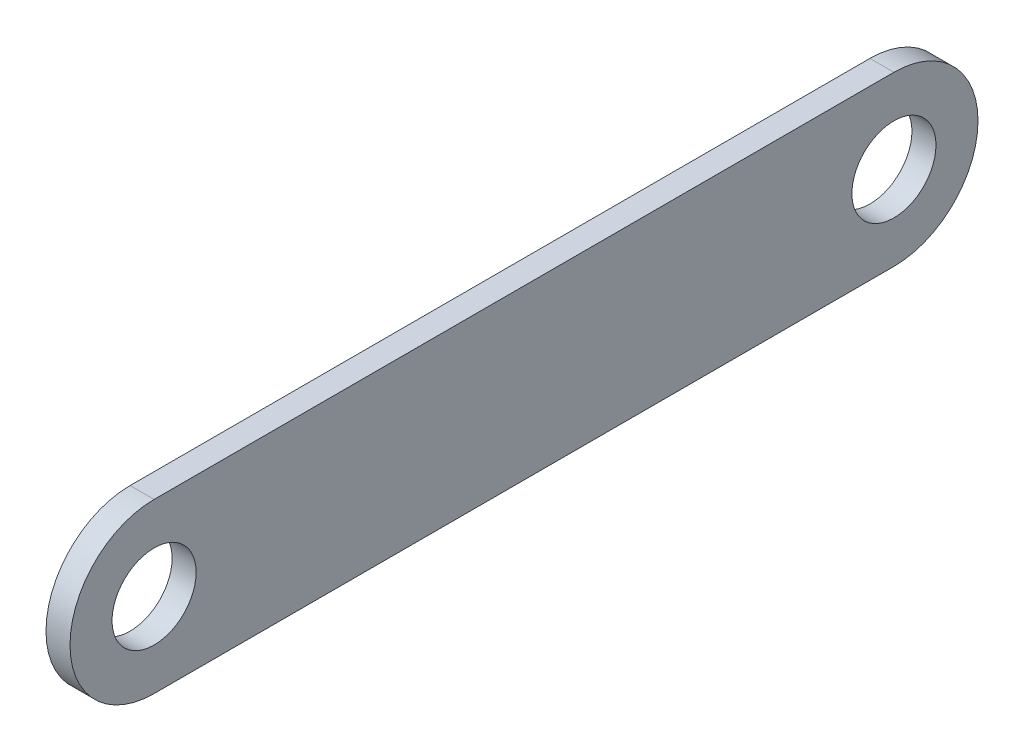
from build123d import *

# Parameters (mm, degrees)
SKETCH1_R           = 17.5
BOSS_EXTRUDE2_DEPTH = 10


with BuildPart() as part:
    # Sketch1 → Boss-Extrude2 (new body)
    with BuildSketch(Plane(origin=(0, 0, 0), x_dir=(0, 0, -1), z_dir=(1, 0, 0))):
        with BuildLine():
            Line((308, -35), (0, -35))
            ThreePointArc((0, -35), (-35, 0), (0, 35))
            Line((0, 35), (308, 35))
            ThreePointArc((308, 35), (343, 0), (308, -35))
        make_face()
        Circle(SKETCH1_R, mode=Mode.SUBTRACT)
        with Locations((308, 0)):
            Circle(SKETCH1_R, mode=Mode.SUBTRACT)
    extrude(amount=BOSS_EXTRUDE2_DEPTH)


solid = part.part
